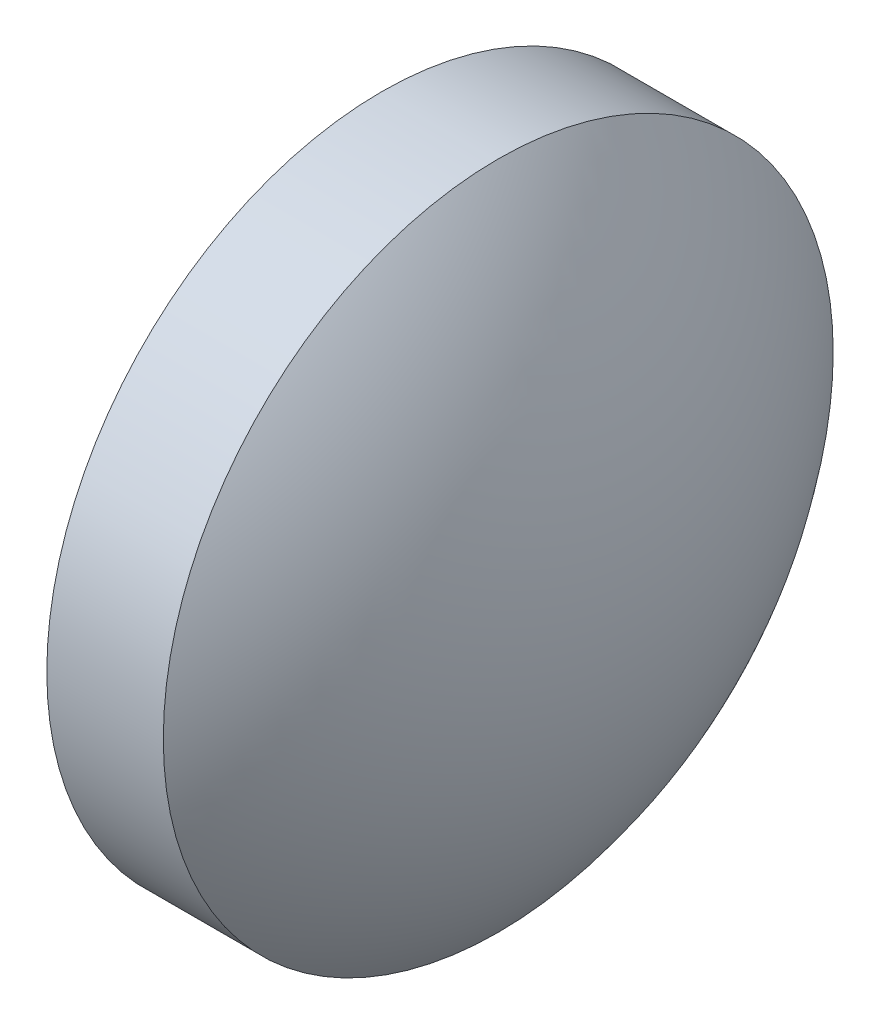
ISO-10303-21;
HEADER;
FILE_DESCRIPTION(('STEP AP214'),'2;1');
FILE_NAME('part.step','',(''),(''),'','','');
FILE_SCHEMA(('AUTOMOTIVE_DESIGN { 1 0 10303 214 1 1 1 1 }'));
ENDSEC;
DATA;
#1=APPLICATION_CONTEXT('core data for automotive mechanical design processes');
#2=APPLICATION_PROTOCOL_DEFINITION('international standard','automotive_design',2000,#1);
#3=PRODUCT_CONTEXT('',#1,'mechanical');
#4=PRODUCT('Part','Part','',(#3));
#5=PRODUCT_RELATED_PRODUCT_CATEGORY('part','',(#4));
#6=PRODUCT_DEFINITION_FORMATION('','',#4);
#7=PRODUCT_DEFINITION_CONTEXT('part definition',#1,'design');
#8=PRODUCT_DEFINITION('design','',#6,#7);
#9=PRODUCT_DEFINITION_SHAPE('','',#8);
#10=(LENGTH_UNIT() NAMED_UNIT(*) SI_UNIT(.MILLI.,.METRE.));
#11=(NAMED_UNIT(*) PLANE_ANGLE_UNIT() SI_UNIT($,.RADIAN.));
#12=(NAMED_UNIT(*) SI_UNIT($,.STERADIAN.) SOLID_ANGLE_UNIT());
#13=UNCERTAINTY_MEASURE_WITH_UNIT(LENGTH_MEASURE(1.E-05),#10,'distance_accuracy_value','');
#14=(GEOMETRIC_REPRESENTATION_CONTEXT(3) GLOBAL_UNCERTAINTY_ASSIGNED_CONTEXT((#13)) GLOBAL_UNIT_ASSIGNED_CONTEXT((#10,
#11,#12)) REPRESENTATION_CONTEXT('',''));
#15=CARTESIAN_POINT('',(0.,0.,0.));
#16=DIRECTION('',(0.,0.,1.));
#17=DIRECTION('',(1.,0.,0.));
#18=AXIS2_PLACEMENT_3D('',#15,#16,#17);
#19=CARTESIAN_POINT('',(26.94,0.,0.));
#20=DIRECTION('',(-1.,0.,0.));
#21=DIRECTION('',(0.,1.,0.));
#22=AXIS2_PLACEMENT_3D('',#19,#20,#21);
#23=SPHERICAL_SURFACE('',#22,11.94);
#24=CARTESIAN_POINT('',(15.3830280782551,0.,0.));
#25=DIRECTION('',(-1.,0.,0.));
#26=DIRECTION('',(0.,0.,1.));
#27=AXIS2_PLACEMENT_3D('',#24,#25,#26);
#28=CIRCLE('',#27,3.);
#29=CARTESIAN_POINT('',(15.3830280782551,0.,3.));
#30=VERTEX_POINT('',#29);
#31=EDGE_CURVE('E37',#30,#30,#28,.T.);
#32=ORIENTED_EDGE('',*,*,#31,.T.);
#33=EDGE_LOOP('',(#32));
#34=FACE_BOUND('',#33,.T.);
#35=ADVANCED_FACE('F31',(#34),#23,.T.);
#36=CARTESIAN_POINT('',(12.7713,0.,0.));
#37=DIRECTION('',(-1.,0.,0.));
#38=DIRECTION('',(0.,1.,0.));
#39=AXIS2_PLACEMENT_3D('',#36,#37,#38);
#40=SPHERICAL_SURFACE('',#39,4.7287);
#41=CARTESIAN_POINT('',(16.4265159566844,0.,0.));
#42=DIRECTION('',(-1.,0.,0.));
#43=DIRECTION('',(0.,0.,1.));
#44=AXIS2_PLACEMENT_3D('',#41,#42,#43);
#45=CIRCLE('',#44,3.);
#46=CARTESIAN_POINT('',(16.4265159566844,0.,3.));
#47=VERTEX_POINT('',#46);
#48=EDGE_CURVE('E10',#47,#47,#45,.T.);
#49=ORIENTED_EDGE('',*,*,#48,.F.);
#50=EDGE_LOOP('',(#49));
#51=FACE_BOUND('',#50,.T.);
#52=ADVANCED_FACE('F46',(#51),#40,.T.);
#53=CARTESIAN_POINT('',(15.,0.,0.));
#54=DIRECTION('',(-1.,0.,0.));
#55=DIRECTION('',(0.,0.,1.));
#56=AXIS2_PLACEMENT_3D('',#53,#54,#55);
#57=CYLINDRICAL_SURFACE('',#56,3.);
#58=ORIENTED_EDGE('',*,*,#31,.F.);
#59=EDGE_LOOP('',(#58));
#60=FACE_BOUND('',#59,.T.);
#61=ORIENTED_EDGE('',*,*,#48,.T.);
#62=EDGE_LOOP('',(#61));
#63=FACE_BOUND('',#62,.T.);
#64=ADVANCED_FACE('F44',(#60,#63),#57,.T.);
#65=CLOSED_SHELL('',(#35,#52,#64));
#66=MANIFOLD_SOLID_BREP('B2',#65);
#67=ADVANCED_BREP_SHAPE_REPRESENTATION('',(#18,#66),#14);
#68=SHAPE_DEFINITION_REPRESENTATION(#9,#67);
ENDSEC;
END-ISO-10303-21;
